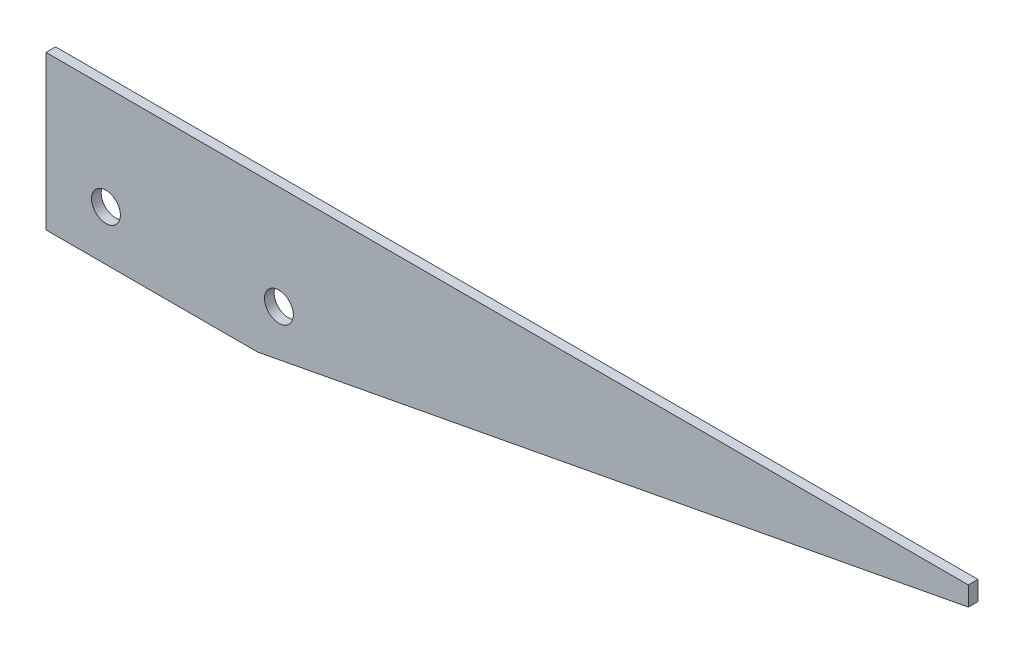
from build123d import *

# Parameters (mm, degrees)
SKETCH1_R           = 4.7625
BOSS_EXTRUDE1_DEPTH = 3.175


with BuildPart() as part:
    # Sketch1 → Boss-Extrude1 (new body)
    with BuildSketch(Plane.XY):
        Polygon((-112.456451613, 37.485483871), (192.343548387, 37.485483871), (192.343548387, 31.135483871), (-42.606451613, -13.314516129), (-112.456451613, -13.314516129), align=None)
        with Locations((-92.644451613, 3.195483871)):
            Circle(SKETCH1_R, mode=Mode.SUBTRACT)
        with Locations((-35.494451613, 3.195483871)):
            Circle(SKETCH1_R, mode=Mode.SUBTRACT)
    extrude(amount=BOSS_EXTRUDE1_DEPTH)


solid = part.part
